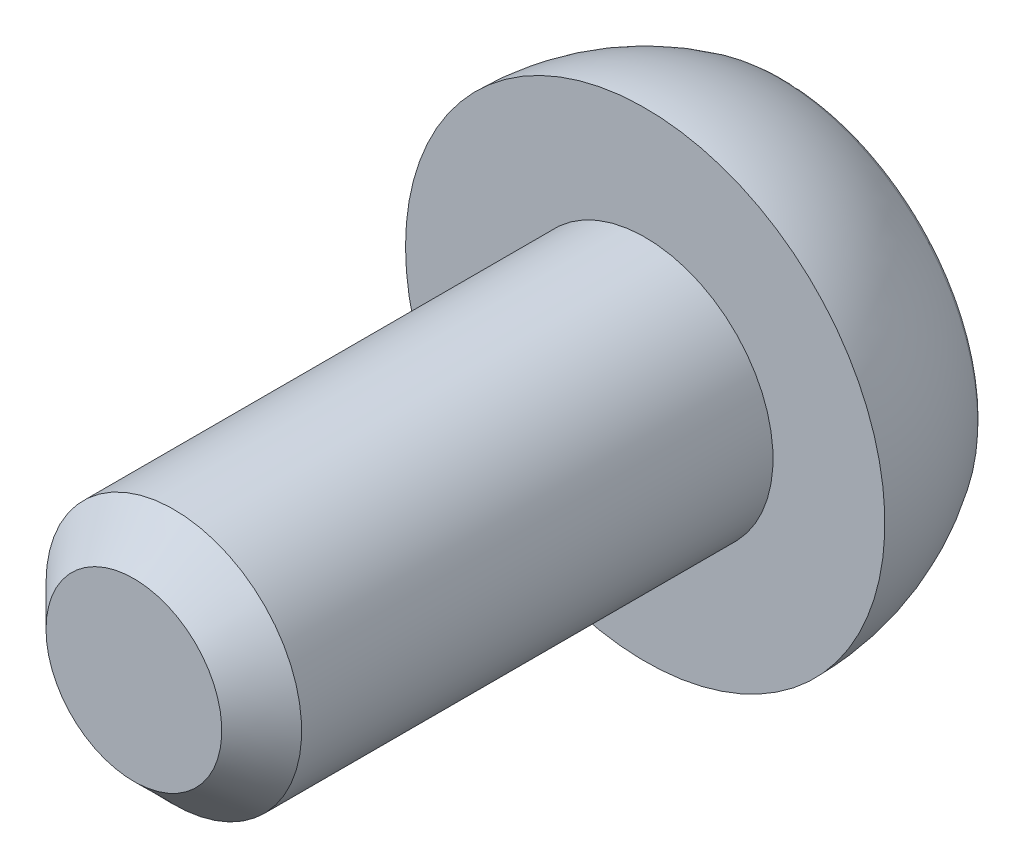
ISO-10303-21;
HEADER;
FILE_DESCRIPTION(('STEP AP214'),'2;1');
FILE_NAME('part.step','',(''),(''),'','','');
FILE_SCHEMA(('AUTOMOTIVE_DESIGN { 1 0 10303 214 1 1 1 1 }'));
ENDSEC;
DATA;
#1=APPLICATION_CONTEXT('core data for automotive mechanical design processes');
#2=APPLICATION_PROTOCOL_DEFINITION('international standard','automotive_design',2000,#1);
#3=PRODUCT_CONTEXT('',#1,'mechanical');
#4=PRODUCT('Part','Part','',(#3));
#5=PRODUCT_RELATED_PRODUCT_CATEGORY('part','',(#4));
#6=PRODUCT_DEFINITION_FORMATION('','',#4);
#7=PRODUCT_DEFINITION_CONTEXT('part definition',#1,'design');
#8=PRODUCT_DEFINITION('design','',#6,#7);
#9=PRODUCT_DEFINITION_SHAPE('','',#8);
#10=(LENGTH_UNIT() NAMED_UNIT(*) SI_UNIT(.MILLI.,.METRE.));
#11=(NAMED_UNIT(*) PLANE_ANGLE_UNIT() SI_UNIT($,.RADIAN.));
#12=(NAMED_UNIT(*) SI_UNIT($,.STERADIAN.) SOLID_ANGLE_UNIT());
#13=UNCERTAINTY_MEASURE_WITH_UNIT(LENGTH_MEASURE(1.E-05),#10,'distance_accuracy_value','');
#14=(GEOMETRIC_REPRESENTATION_CONTEXT(3) GLOBAL_UNCERTAINTY_ASSIGNED_CONTEXT((#13)) GLOBAL_UNIT_ASSIGNED_CONTEXT((#10,
#11,#12)) REPRESENTATION_CONTEXT('',''));
#15=CARTESIAN_POINT('',(0.,0.,0.));
#16=DIRECTION('',(0.,0.,1.));
#17=DIRECTION('',(1.,0.,0.));
#18=AXIS2_PLACEMENT_3D('',#15,#16,#17);
#19=CARTESIAN_POINT('',(63.50170234,216.57144045,-19.));
#20=DIRECTION('',(0.,0.,-1.));
#21=DIRECTION('',(-0.999977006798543,-0.00678128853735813,0.));
#22=AXIS2_PLACEMENT_3D('',#19,#20,#21);
#23=PLANE('',#22);
#24=CARTESIAN_POINT('',(60.699894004,219.335504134,-19.));
#25=DIRECTION('',(0.,0.,-1.));
#26=DIRECTION('',(-1.,0.,0.));
#27=AXIS2_PLACEMENT_3D('',#24,#25,#26);
#28=CIRCLE('',#27,2.75000000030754);
#29=CARTESIAN_POINT('',(57.9498940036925,219.335504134,-19.));
#30=VERTEX_POINT('',#29);
#31=EDGE_CURVE('E17',#30,#30,#28,.F.);
#32=ORIENTED_EDGE('',*,*,#31,.T.);
#33=EDGE_LOOP('',(#32));
#34=FACE_BOUND('',#33,.T.);
#35=ADVANCED_FACE('F12',(#34),#23,.F.);
#36=CARTESIAN_POINT('',(60.699894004,219.335504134,-19.));
#37=DIRECTION('',(0.,0.,-1.));
#38=DIRECTION('',(-1.,0.,0.));
#39=AXIS2_PLACEMENT_3D('',#36,#37,#38);
#40=CONICAL_SURFACE('',#39,2.75000000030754,0.785398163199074);
#41=CARTESIAN_POINT('',(60.699894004,219.335504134,-20.25));
#42=DIRECTION('',(0.,0.,-1.));
#43=DIRECTION('',(-0.999977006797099,-0.00678128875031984,0.));
#44=AXIS2_PLACEMENT_3D('',#41,#42,#43);
#45=CIRCLE('',#44,3.9999999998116);
#46=CARTESIAN_POINT('',(56.699985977,219.308378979,-20.25));
#47=VERTEX_POINT('',#46);
#48=EDGE_CURVE('E95',#47,#47,#45,.F.);
#49=ORIENTED_EDGE('',*,*,#48,.T.);
#50=EDGE_LOOP('',(#49));
#51=FACE_BOUND('',#50,.T.);
#52=ORIENTED_EDGE('',*,*,#31,.F.);
#53=EDGE_LOOP('',(#52));
#54=FACE_BOUND('',#53,.T.);
#55=ADVANCED_FACE('F262',(#51,#54),#40,.T.);
#56=CARTESIAN_POINT('',(65.729142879,215.039383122,-35.5));
#57=DIRECTION('',(0.,0.,-1.));
#58=DIRECTION('',(-0.99997700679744,-0.00678128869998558,0.));
#59=AXIS2_PLACEMENT_3D('',#56,#57,#58);
#60=PLANE('',#59);
#61=DIRECTION('',(-0.49411573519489,-0.869396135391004,0.));
#62=VECTOR('',#61,1.);
#63=CARTESIAN_POINT('',(64.4644897,217.1959202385,-35.5));
#64=LINE('',#63,#62);
#65=CARTESIAN_POINT('',(65.6997790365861,219.369410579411,-35.5));
#66=VERTEX_POINT('',#65);
#67=CARTESIAN_POINT('',(63.229200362,215.022429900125,-35.5));
#68=VERTEX_POINT('',#67);
#69=EDGE_CURVE('E107',#66,#68,#64,.T.);
#70=ORIENTED_EDGE('',*,*,#69,.T.);
#71=DIRECTION('',(-0.999977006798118,-0.00678128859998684,0.));
#72=VECTOR('',#71,1.);
#73=CARTESIAN_POINT('',(60.729257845,215.0054766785,-35.5));
#74=LINE('',#73,#72);
#75=CARTESIAN_POINT('',(58.229315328,214.988523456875,-35.5));
#76=VERTEX_POINT('',#75);
#77=EDGE_CURVE('E86',#68,#76,#74,.T.);
#78=ORIENTED_EDGE('',*,*,#77,.T.);
#79=DIRECTION('',(-0.505861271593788,0.862614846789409,0.));
#80=VECTOR('',#79,1.);
#81=CARTESIAN_POINT('',(56.964662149,217.145060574,-35.5));
#82=LINE('',#81,#80);
#83=CARTESIAN_POINT('',(55.7000089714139,219.301597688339,-35.5));
#84=VERTEX_POINT('',#83);
#85=EDGE_CURVE('E81',#76,#84,#82,.T.);
#86=ORIENTED_EDGE('',*,*,#85,.T.);
#87=DIRECTION('',(0.494115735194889,0.869396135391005,0.));
#88=VECTOR('',#87,1.);
#89=CARTESIAN_POINT('',(56.935298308,221.4750880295,-35.5));
#90=LINE('',#89,#88);
#91=CARTESIAN_POINT('',(58.170587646,223.648578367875,-35.5));
#92=VERTEX_POINT('',#91);
#93=EDGE_CURVE('E84',#84,#92,#90,.T.);
#94=ORIENTED_EDGE('',*,*,#93,.T.);
#95=DIRECTION('',(0.999977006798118,0.00678128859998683,0.));
#96=VECTOR('',#95,1.);
#97=CARTESIAN_POINT('',(60.670530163,223.6655315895,-35.5));
#98=LINE('',#97,#96);
#99=CARTESIAN_POINT('',(63.17047268,223.68248481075,-35.5));
#100=VERTEX_POINT('',#99);
#101=EDGE_CURVE('E67',#92,#100,#98,.T.);
#102=ORIENTED_EDGE('',*,*,#101,.T.);
#103=DIRECTION('',(0.505861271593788,-0.862614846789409,0.));
#104=VECTOR('',#103,1.);
#105=CARTESIAN_POINT('',(64.435125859,221.525947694,-35.5));
#106=LINE('',#105,#104);
#107=EDGE_CURVE('E114',#100,#66,#106,.T.);
#108=ORIENTED_EDGE('',*,*,#107,.T.);
#109=EDGE_LOOP('',(#70,#78,#86,#94,#102,#108));
#110=FACE_BOUND('',#109,.T.);
#111=ADVANCED_FACE('F83',(#110),#60,.T.);
#112=CARTESIAN_POINT('',(60.699894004,219.335504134,-20.25));
#113=DIRECTION('',(0.,0.,-1.));
#114=DIRECTION('',(-1.,0.,0.));
#115=AXIS2_PLACEMENT_3D('',#112,#113,#114);
#116=CYLINDRICAL_SURFACE('',#115,3.99999999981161);
#117=CARTESIAN_POINT('',(60.699894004,219.335504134,-35.));
#118=DIRECTION('',(0.,0.,-1.));
#119=DIRECTION('',(-1.,0.,0.));
#120=AXIS2_PLACEMENT_3D('',#117,#118,#119);
#121=CIRCLE('',#120,3.99999999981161);
#122=CARTESIAN_POINT('',(56.6998940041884,219.335504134,-35.));
#123=VERTEX_POINT('',#122);
#124=EDGE_CURVE('E127',#123,#123,#121,.F.);
#125=ORIENTED_EDGE('',*,*,#124,.T.);
#126=EDGE_LOOP('',(#125));
#127=FACE_BOUND('',#126,.T.);
#128=ORIENTED_EDGE('',*,*,#48,.F.);
#129=EDGE_LOOP('',(#128));
#130=FACE_BOUND('',#129,.T.);
#131=ADVANCED_FACE('F260',(#127,#130),#116,.T.);
#132=CARTESIAN_POINT('',(58.170587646,223.648578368,-39.4));
#133=DIRECTION('',(-0.869396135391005,0.494115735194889,0.));
#134=DIRECTION('',(-0.494115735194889,-0.869396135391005,0.));
#135=AXIS2_PLACEMENT_3D('',#132,#133,#134);
#136=PLANE('',#135);
#137=DIRECTION('',(0.,0.,1.));
#138=VECTOR('',#137,1.);
#139=CARTESIAN_POINT('',(58.170587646,223.648578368,-37.45));
#140=LINE('',#139,#138);
#141=CARTESIAN_POINT('',(58.170587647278,223.648578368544,-39.4));
#142=VERTEX_POINT('',#141);
#143=EDGE_CURVE('E94',#142,#92,#140,.T.);
#144=ORIENTED_EDGE('',*,*,#143,.T.);
#145=ORIENTED_EDGE('',*,*,#93,.F.);
#146=DIRECTION('',(0.,0.,-1.));
#147=VECTOR('',#146,1.);
#148=CARTESIAN_POINT('',(55.70000897,219.301597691,-37.45));
#149=LINE('',#148,#147);
#150=CARTESIAN_POINT('',(55.7000089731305,219.30159769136,-39.4));
#151=VERTEX_POINT('',#150);
#152=EDGE_CURVE('E90',#84,#151,#149,.T.);
#153=ORIENTED_EDGE('',*,*,#152,.T.);
#154=DIRECTION('',(-0.494115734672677,-0.8693961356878,0.));
#155=VECTOR('',#154,1.);
#156=CARTESIAN_POINT('',(58.1705876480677,223.648578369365,-39.4));
#157=LINE('',#156,#155);
#158=EDGE_CURVE('E58',#142,#151,#157,.T.);
#159=ORIENTED_EDGE('',*,*,#158,.F.);
#160=EDGE_LOOP('',(#144,#145,#153,#159));
#161=FACE_BOUND('',#160,.T.);
#162=ADVANCED_FACE('F92',(#161),#136,.F.);
#163=CARTESIAN_POINT('',(55.70000897,219.301597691,-39.4));
#164=DIRECTION('',(-0.862614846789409,-0.505861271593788,0.));
#165=DIRECTION('',(0.505861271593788,-0.862614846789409,0.));
#166=AXIS2_PLACEMENT_3D('',#163,#164,#165);
#167=PLANE('',#166);
#168=ORIENTED_EDGE('',*,*,#152,.F.);
#169=ORIENTED_EDGE('',*,*,#85,.F.);
#170=DIRECTION('',(0.,0.,-1.));
#171=VECTOR('',#170,1.);
#172=CARTESIAN_POINT('',(58.229315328,214.988523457,-37.45));
#173=LINE('',#172,#171);
#174=CARTESIAN_POINT('',(58.2293153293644,214.988523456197,-39.4));
#175=VERTEX_POINT('',#174);
#176=EDGE_CURVE('E101',#76,#175,#173,.T.);
#177=ORIENTED_EDGE('',*,*,#176,.T.);
#178=DIRECTION('',(0.505861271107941,-0.862614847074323,0.));
#179=VECTOR('',#178,1.);
#180=CARTESIAN_POINT('',(55.7000089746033,219.301597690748,-39.4));
#181=LINE('',#180,#179);
#182=EDGE_CURVE('E99',#151,#175,#181,.T.);
#183=ORIENTED_EDGE('',*,*,#182,.F.);
#184=EDGE_LOOP('',(#168,#169,#177,#183));
#185=FACE_BOUND('',#184,.T.);
#186=ADVANCED_FACE('F97',(#185),#167,.F.);
#187=CARTESIAN_POINT('',(58.229315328,214.988523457,-35.5));
#188=DIRECTION('',(0.00678128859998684,-0.999977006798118,0.));
#189=DIRECTION('',(0.,0.,-1.));
#190=AXIS2_PLACEMENT_3D('',#187,#188,#189);
#191=PLANE('',#190);
#192=ORIENTED_EDGE('',*,*,#176,.F.);
#193=ORIENTED_EDGE('',*,*,#77,.F.);
#194=DIRECTION('',(0.,0.,-1.));
#195=VECTOR('',#194,1.);
#196=CARTESIAN_POINT('',(63.229200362,215.0224299,-37.45));
#197=LINE('',#196,#195);
#198=CARTESIAN_POINT('',(63.2292003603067,215.022429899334,-39.4));
#199=VERTEX_POINT('',#198);
#200=EDGE_CURVE('E112',#68,#199,#197,.T.);
#201=ORIENTED_EDGE('',*,*,#200,.T.);
#202=DIRECTION('',(0.999977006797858,0.00678128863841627,0.));
#203=VECTOR('',#202,1.);
#204=CARTESIAN_POINT('',(60.7292578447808,215.005476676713,-39.4));
#205=LINE('',#204,#203);
#206=EDGE_CURVE('E108',#175,#199,#205,.T.);
#207=ORIENTED_EDGE('',*,*,#206,.F.);
#208=EDGE_LOOP('',(#192,#193,#201,#207));
#209=FACE_BOUND('',#208,.T.);
#210=ADVANCED_FACE('F252',(#209),#191,.F.);
#211=CARTESIAN_POINT('',(63.229200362,215.0224299,-39.4));
#212=DIRECTION('',(0.869396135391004,-0.49411573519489,0.));
#213=DIRECTION('',(0.49411573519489,0.869396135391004,0.));
#214=AXIS2_PLACEMENT_3D('',#211,#212,#213);
#215=PLANE('',#214);
#216=ORIENTED_EDGE('',*,*,#200,.F.);
#217=ORIENTED_EDGE('',*,*,#69,.F.);
#218=DIRECTION('',(0.,0.,-1.));
#219=VECTOR('',#218,1.);
#220=CARTESIAN_POINT('',(65.699779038,219.369410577,-37.45));
#221=LINE('',#220,#219);
#222=CARTESIAN_POINT('',(65.6997790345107,219.369410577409,-39.4));
#223=VERTEX_POINT('',#222);
#224=EDGE_CURVE('E181',#66,#223,#221,.T.);
#225=ORIENTED_EDGE('',*,*,#224,.T.);
#226=DIRECTION('',(0.494115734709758,0.869396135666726,0.));
#227=VECTOR('',#226,1.);
#228=CARTESIAN_POINT('',(63.2292003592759,215.022429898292,-39.4));
#229=LINE('',#228,#227);
#230=EDGE_CURVE('E111',#199,#223,#229,.T.);
#231=ORIENTED_EDGE('',*,*,#230,.F.);
#232=EDGE_LOOP('',(#216,#217,#225,#231));
#233=FACE_BOUND('',#232,.T.);
#234=ADVANCED_FACE('F246',(#233),#215,.F.);
#235=CARTESIAN_POINT('',(65.699779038,219.369410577,-39.4));
#236=DIRECTION('',(0.862614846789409,0.505861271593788,0.));
#237=DIRECTION('',(-0.505861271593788,0.862614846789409,0.));
#238=AXIS2_PLACEMENT_3D('',#235,#236,#237);
#239=PLANE('',#238);
#240=ORIENTED_EDGE('',*,*,#224,.F.);
#241=ORIENTED_EDGE('',*,*,#107,.F.);
#242=DIRECTION('',(0.,0.,-1.));
#243=VECTOR('',#242,1.);
#244=CARTESIAN_POINT('',(63.17047268,223.682484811,-37.45));
#245=LINE('',#244,#243);
#246=CARTESIAN_POINT('',(63.1704726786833,223.682484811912,-39.4));
#247=VERTEX_POINT('',#246);
#248=EDGE_CURVE('E139',#100,#247,#245,.T.);
#249=ORIENTED_EDGE('',*,*,#248,.T.);
#250=DIRECTION('',(-0.505861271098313,0.862614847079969,0.));
#251=VECTOR('',#250,1.);
#252=CARTESIAN_POINT('',(65.6997790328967,219.369410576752,-39.4));
#253=LINE('',#252,#251);
#254=EDGE_CURVE('E119',#223,#247,#253,.T.);
#255=ORIENTED_EDGE('',*,*,#254,.F.);
#256=EDGE_LOOP('',(#240,#241,#249,#255));
#257=FACE_BOUND('',#256,.T.);
#258=ADVANCED_FACE('F242',(#257),#239,.F.);
#259=CARTESIAN_POINT('',(58.170587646,223.648578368,-39.4));
#260=DIRECTION('',(-0.00678128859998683,0.999977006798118,0.));
#261=DIRECTION('',(0.,0.,1.));
#262=AXIS2_PLACEMENT_3D('',#259,#260,#261);
#263=PLANE('',#262);
#264=ORIENTED_EDGE('',*,*,#248,.F.);
#265=ORIENTED_EDGE('',*,*,#101,.F.);
#266=ORIENTED_EDGE('',*,*,#143,.F.);
#267=DIRECTION('',(-0.999977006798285,-0.00678128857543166,0.));
#268=VECTOR('',#267,1.);
#269=CARTESIAN_POINT('',(60.6705301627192,223.665531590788,-39.4));
#270=LINE('',#269,#268);
#271=EDGE_CURVE('E122',#247,#142,#270,.T.);
#272=ORIENTED_EDGE('',*,*,#271,.F.);
#273=EDGE_LOOP('',(#264,#265,#266,#272));
#274=FACE_BOUND('',#273,.T.);
#275=ADVANCED_FACE('F194',(#274),#263,.F.);
#276=CARTESIAN_POINT('',(60.739313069,213.52272114,-39.4));
#277=CARTESIAN_POINT('',(49.113747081,213.443883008,-39.4));
#278=CARTESIAN_POINT('',(49.03490895,225.069448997,-39.4));
#279=CARTESIAN_POINT('',(60.660474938,225.148287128,-39.4));
#280=CARTESIAN_POINT('',(60.740467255,213.35252351,-39.4));
#281=CARTESIAN_POINT('',(48.774506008,213.271377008,-39.4));
#282=CARTESIAN_POINT('',(48.693359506,225.237338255,-39.4));
#283=CARTESIAN_POINT('',(60.659320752,225.318484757,-39.4));
#284=CARTESIAN_POINT('',(60.741485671,213.202346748,-39.319909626));
#285=CARTESIAN_POINT('',(48.475170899,213.119163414,-39.319909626));
#286=CARTESIAN_POINT('',(48.391987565,225.385478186,-39.319909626));
#287=CARTESIAN_POINT('',(60.658302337,225.46866152,-39.319909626));
#288=CARTESIAN_POINT('',(60.742128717,213.107522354,-39.178571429));
#289=CARTESIAN_POINT('',(48.286165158,213.023052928,-39.178571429));
#290=CARTESIAN_POINT('',(48.201695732,225.479016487,-39.178571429));
#291=CARTESIAN_POINT('',(60.657659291,225.563485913,-39.178571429));
#292=(BOUNDED_SURFACE() B_SPLINE_SURFACE(3,3,((#276,#277,#278,#279),(#280,#281,#282,#283),(#284,
#285,#286,#287),(#288,#289,#290,#291)),.UNSPECIFIED.,.F.,.F.,
.F.) B_SPLINE_SURFACE_WITH_KNOTS((4,4),(4,4),(0.,1.),(0.,1.),
.UNSPECIFIED.) GEOMETRIC_REPRESENTATION_ITEM() RATIONAL_B_SPLINE_SURFACE(((1.,0.333333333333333,
0.333333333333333,1.),(0.921577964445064,0.307192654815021,0.307192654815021,0.921577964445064),
(0.921577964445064,0.307192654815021,0.307192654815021,0.921577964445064),(1.,0.333333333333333,
0.333333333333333,1.))) REPRESENTATION_ITEM('') SURFACE());
#293=CARTESIAN_POINT('',(60.660474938,225.148287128,-39.4));
#294=CARTESIAN_POINT('',(60.659320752,225.318484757,-39.4));
#295=CARTESIAN_POINT('',(60.658302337,225.46866152,-39.319909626));
#296=CARTESIAN_POINT('',(60.657659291,225.563485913,-39.178571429));
#297=(BOUNDED_CURVE() B_SPLINE_CURVE(3,(#293,#294,#295,#296),.UNSPECIFIED.,.F.,
.F.) B_SPLINE_CURVE_WITH_KNOTS((4,4),(0.,1.),
.UNSPECIFIED.) CURVE() GEOMETRIC_REPRESENTATION_ITEM() RATIONAL_B_SPLINE_CURVE((1.,
0.921577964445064,0.921577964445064,1.)) REPRESENTATION_ITEM(''));
#298=CARTESIAN_POINT('',(60.6576592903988,225.563485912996,-39.178571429));
#299=VERTEX_POINT('',#298);
#300=CARTESIAN_POINT('',(60.6604749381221,225.148287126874,-39.4));
#301=VERTEX_POINT('',#300);
#302=EDGE_CURVE('E129',#299,#301,#297,.F.);
#303=CARTESIAN_POINT('',(60.660474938,225.148287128,-39.4));
#304=CARTESIAN_POINT('',(49.03490895,225.069448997,-39.4));
#305=CARTESIAN_POINT('',(49.113747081,213.443883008,-39.4));
#306=CARTESIAN_POINT('',(60.739313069,213.52272114,-39.4));
#307=(BOUNDED_CURVE() B_SPLINE_CURVE(3,(#303,#304,#305,#306),.UNSPECIFIED.,.F.,
.F.) B_SPLINE_CURVE_WITH_KNOTS((4,4),(0.,1.),
.UNSPECIFIED.) CURVE() GEOMETRIC_REPRESENTATION_ITEM() RATIONAL_B_SPLINE_CURVE((1.,
0.333333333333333,0.333333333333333,1.)) REPRESENTATION_ITEM(''));
#308=CARTESIAN_POINT('',(60.7393130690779,213.522721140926,-39.4));
#309=VERTEX_POINT('',#308);
#310=EDGE_CURVE('E126',#309,#301,#307,.F.);
#311=CARTESIAN_POINT('',(60.739313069,213.52272114,-39.4));
#312=CARTESIAN_POINT('',(60.740467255,213.35252351,-39.4));
#313=CARTESIAN_POINT('',(60.741485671,213.202346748,-39.319909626));
#314=CARTESIAN_POINT('',(60.742128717,213.107522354,-39.178571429));
#315=(BOUNDED_CURVE() B_SPLINE_CURVE(3,(#311,#312,#313,#314),.UNSPECIFIED.,.F.,
.F.) B_SPLINE_CURVE_WITH_KNOTS((4,4),(0.,1.),
.UNSPECIFIED.) CURVE() GEOMETRIC_REPRESENTATION_ITEM() RATIONAL_B_SPLINE_CURVE((1.,
0.921577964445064,0.921577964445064,1.)) REPRESENTATION_ITEM(''));
#316=CARTESIAN_POINT('',(60.7421287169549,213.107522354,-39.178571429));
#317=VERTEX_POINT('',#316);
#318=EDGE_CURVE('E133',#309,#317,#315,.T.);
#319=CARTESIAN_POINT('',(60.699894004,219.335504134,-39.1785713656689));
#320=DIRECTION('',(0.,0.,-1.));
#321=DIRECTION('',(0.999977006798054,0.00678128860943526,0.));
#322=AXIS2_PLACEMENT_3D('',#319,#320,#321);
#323=CIRCLE('',#322,6.22812502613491);
#324=EDGE_CURVE('E118',#317,#299,#323,.T.);
#325=ORIENTED_EDGE('',*,*,#302,.T.);
#326=ORIENTED_EDGE('',*,*,#310,.F.);
#327=ORIENTED_EDGE('',*,*,#318,.T.);
#328=ORIENTED_EDGE('',*,*,#324,.T.);
#329=EDGE_LOOP('',(#325,#326,#327,#328));
#330=FACE_BOUND('',#329,.T.);
#331=ADVANCED_FACE('F208',(#330),#292,.T.);
#332=CARTESIAN_POINT('',(68.341189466,211.797148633,-35.));
#333=DIRECTION('',(0.,0.,-1.));
#334=DIRECTION('',(-0.999977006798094,-0.00678128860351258,0.));
#335=AXIS2_PLACEMENT_3D('',#332,#333,#334);
#336=PLANE('',#335);
#337=ORIENTED_EDGE('',*,*,#124,.F.);
#338=EDGE_LOOP('',(#337));
#339=FACE_BOUND('',#338,.T.);
#340=CARTESIAN_POINT('',(60.699894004,219.335504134,-35.));
#341=DIRECTION('',(0.,0.,-1.));
#342=DIRECTION('',(-1.,0.,0.));
#343=AXIS2_PLACEMENT_3D('',#340,#341,#342);
#344=CIRCLE('',#343,7.50000000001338);
#345=CARTESIAN_POINT('',(53.1998940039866,219.335504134,-35.));
#346=VERTEX_POINT('',#345);
#347=EDGE_CURVE('E115',#346,#346,#344,.F.);
#348=ORIENTED_EDGE('',*,*,#347,.T.);
#349=EDGE_LOOP('',(#348));
#350=FACE_BOUND('',#349,.T.);
#351=ADVANCED_FACE('F236',(#339,#350),#336,.F.);
#352=CARTESIAN_POINT('',(54.857249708,213.413075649,-39.4));
#353=DIRECTION('',(0.,0.,-1.));
#354=DIRECTION('',(-0.00678128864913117,0.999977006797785,0.));
#355=AXIS2_PLACEMENT_3D('',#352,#353,#354);
#356=PLANE('',#355);
#357=ORIENTED_EDGE('',*,*,#254,.T.);
#358=ORIENTED_EDGE('',*,*,#271,.T.);
#359=ORIENTED_EDGE('',*,*,#158,.T.);
#360=ORIENTED_EDGE('',*,*,#182,.T.);
#361=ORIENTED_EDGE('',*,*,#206,.T.);
#362=ORIENTED_EDGE('',*,*,#230,.T.);
#363=EDGE_LOOP('',(#357,#358,#359,#360,#361,#362));
#364=FACE_BOUND('',#363,.T.);
#365=CARTESIAN_POINT('',(60.739313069,213.52272114,-39.4));
#366=CARTESIAN_POINT('',(60.8008187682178,213.523137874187,-39.4));
#367=CARTESIAN_POINT('',(60.8623179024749,213.524531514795,-39.4));
#368=CARTESIAN_POINT('',(60.9871907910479,213.529344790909,-39.4));
#369=CARTESIAN_POINT('',(61.0505621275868,213.532827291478,-39.4));
#370=CARTESIAN_POINT('',(61.1791615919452,213.542008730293,-39.4));
#371=CARTESIAN_POINT('',(61.2443849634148,213.54777437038,-39.4));
#372=CARTESIAN_POINT('',(61.3766560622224,213.561722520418,-39.4));
#373=CARTESIAN_POINT('',(61.443696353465,213.569975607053,-39.4));
#374=CARTESIAN_POINT('',(61.5795521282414,213.589109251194,-39.4));
#375=CARTESIAN_POINT('',(61.6483571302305,213.600064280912,-39.4));
#376=CARTESIAN_POINT('',(61.787674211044,213.624821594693,-39.4));
#377=CARTESIAN_POINT('',(61.8581723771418,213.638702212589,-39.4));
#378=CARTESIAN_POINT('',(62.0007863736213,213.669538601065,-39.4));
#379=CARTESIAN_POINT('',(62.0728844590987,213.686576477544,-39.4));
#380=CARTESIAN_POINT('',(62.2185851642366,213.723961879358,-39.4));
#381=CARTESIAN_POINT('',(62.2921657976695,213.744395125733,-39.4));
#382=CARTESIAN_POINT('',(62.4406922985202,213.78881043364,-39.4));
#383=CARTESIAN_POINT('',(62.5156115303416,213.812881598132,-39.4));
#384=CARTESIAN_POINT('',(62.6666473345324,213.864814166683,-39.4));
#385=CARTESIAN_POINT('',(62.7427322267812,213.892767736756,-39.4));
#386=CARTESIAN_POINT('',(62.8959005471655,213.952705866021,-39.4));
#387=CARTESIAN_POINT('',(62.9729468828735,213.984785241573,-39.4));
#388=CARTESIAN_POINT('',(63.1278062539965,214.053211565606,-39.4));
#389=CARTESIAN_POINT('',(63.2055764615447,214.089655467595,-39.4));
#390=CARTESIAN_POINT('',(63.3616168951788,214.16703919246,-39.4));
#391=CARTESIAN_POINT('',(63.4398382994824,214.208077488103,-39.4));
#392=CARTESIAN_POINT('',(63.596478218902,214.294865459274,-39.4));
#393=CARTESIAN_POINT('',(63.6748417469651,214.340714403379,-39.4));
#394=CARTESIAN_POINT('',(63.8314259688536,214.437321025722,-39.4));
#395=CARTESIAN_POINT('',(63.9095854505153,214.48817794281,-39.4));
#396=CARTESIAN_POINT('',(64.0653845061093,214.594974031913,-39.4));
#397=CARTESIAN_POINT('',(64.1429567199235,214.651011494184,-39.4));
#398=CARTESIAN_POINT('',(64.2971678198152,214.768312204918,-39.4));
#399=CARTESIAN_POINT('',(64.3737334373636,214.829671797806,-39.4));
#400=CARTESIAN_POINT('',(64.5254833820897,214.95772385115,-39.4));
#401=CARTESIAN_POINT('',(64.6005889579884,215.024509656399,-39.4));
#402=CARTESIAN_POINT('',(64.7489392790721,215.163478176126,-39.4));
#403=CARTESIAN_POINT('',(64.8221004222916,215.235750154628,-39.4));
#404=CARTESIAN_POINT('',(64.9660549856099,215.385705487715,-39.4));
#405=CARTESIAN_POINT('',(65.0367608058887,215.463472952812,-39.4));
#406=CARTESIAN_POINT('',(65.1752760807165,215.624378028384,-39.4));
#407=CARTESIAN_POINT('',(65.2429950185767,215.707593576,-39.4));
#408=CARTESIAN_POINT('',(65.374992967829,215.879292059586,-39.4));
#409=CARTESIAN_POINT('',(65.4391798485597,215.967845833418,-39.4));
#410=CARTESIAN_POINT('',(65.5635638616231,216.150052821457,-39.4));
#411=CARTESIAN_POINT('',(65.6236687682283,216.243769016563,-39.4));
#412=CARTESIAN_POINT('',(65.7393406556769,216.436060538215,-39.4));
#413=CARTESIAN_POINT('',(65.7948169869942,216.534690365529,-39.4));
#414=CARTESIAN_POINT('',(65.9007015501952,216.736509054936,-39.4));
#415=CARTESIAN_POINT('',(65.9510226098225,216.839743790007,-39.4));
#416=CARTESIAN_POINT('',(66.0220853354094,216.997205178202,-39.4));
#417=CARTESIAN_POINT('',(66.0451403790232,217.050399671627,-39.4));
#418=CARTESIAN_POINT('',(66.0897858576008,217.157783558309,-39.4));
#419=CARTESIAN_POINT('',(66.1113664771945,217.21197704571,-39.4));
#420=CARTESIAN_POINT('',(66.1530044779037,217.321297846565,-39.4));
#421=CARTESIAN_POINT('',(66.1730525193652,217.376428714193,-39.4));
#422=CARTESIAN_POINT('',(66.2115712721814,217.487561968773,-39.4));
#423=CARTESIAN_POINT('',(66.2300331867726,217.54356740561,-39.4));
#424=CARTESIAN_POINT('',(66.2653285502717,217.656382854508,-39.4));
#425=CARTESIAN_POINT('',(66.2821537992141,217.713195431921,-39.4));
#426=CARTESIAN_POINT('',(66.3141285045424,217.827554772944,-39.4));
#427=CARTESIAN_POINT('',(66.3292704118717,217.885103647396,-39.4));
#428=CARTESIAN_POINT('',(66.357835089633,218.000861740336,-39.4));
#429=CARTESIAN_POINT('',(66.3712510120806,218.059072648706,-39.4));
#430=CARTESIAN_POINT('',(66.3963246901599,218.176077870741,-39.4));
#431=CARTESIAN_POINT('',(66.4079763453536,218.234873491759,-39.4));
#432=CARTESIAN_POINT('',(66.4294870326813,218.352968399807,-39.4));
#433=CARTESIAN_POINT('',(66.4393407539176,218.412268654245,-39.4));
#434=CARTESIAN_POINT('',(66.4572259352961,218.531290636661,-39.4));
#435=CARTESIAN_POINT('',(66.4652529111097,218.591013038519,-39.4));
#436=CARTESIAN_POINT('',(66.4794599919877,218.710795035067,-39.4));
#437=CARTESIAN_POINT('',(66.4856364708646,218.770855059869,-39.4));
#438=CARTESIAN_POINT('',(66.4961231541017,218.891226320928,-39.4));
#439=CARTESIAN_POINT('',(66.5004306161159,218.951537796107,-39.4));
#440=CARTESIAN_POINT('',(66.5071652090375,219.072324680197,-39.4));
#441=CARTESIAN_POINT('',(66.5095905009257,219.132800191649,-39.4));
#442=CARTESIAN_POINT('',(66.5125521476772,219.253826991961,-39.4));
#443=CARTESIAN_POINT('',(66.5130875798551,219.314378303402,-39.4));
#444=CARTESIAN_POINT('',(66.5122664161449,219.435468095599,-39.4));
#445=CARTESIAN_POINT('',(66.5109098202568,219.496006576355,-39.4));
#446=CARTESIAN_POINT('',(66.5063070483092,219.616982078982,-39.4));
#447=CARTESIAN_POINT('',(66.5030617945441,219.677419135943,-39.4));
#448=CARTESIAN_POINT('',(66.4946896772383,219.798103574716,-39.4));
#449=CARTESIAN_POINT('',(66.4895646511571,219.858351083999,-39.4));
#450=CARTESIAN_POINT('',(66.4774464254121,219.978569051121,-39.4));
#451=CARTESIAN_POINT('',(66.4704559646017,220.038539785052,-39.4));
#452=CARTESIAN_POINT('',(66.4546256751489,220.158118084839,-39.4));
#453=CARTESIAN_POINT('',(66.4457894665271,220.217726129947,-39.4));
#454=CARTESIAN_POINT('',(66.4262917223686,220.336494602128,-39.4));
#455=CARTESIAN_POINT('',(66.4156346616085,220.395655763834,-39.4));
#456=CARTESIAN_POINT('',(66.3925243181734,220.513448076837,-39.4));
#457=CARTESIAN_POINT('',(66.3800763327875,220.572080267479,-39.4));
#458=CARTESIAN_POINT('',(66.3534181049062,220.688734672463,-39.4));
#459=CARTESIAN_POINT('',(66.3392139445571,220.746758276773,-39.4));
#460=CARTESIAN_POINT('',(66.3090819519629,220.862118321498,-39.4));
#461=CARTESIAN_POINT('',(66.2931609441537,220.919456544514,-39.4));
#462=CARTESIAN_POINT('',(66.2596382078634,221.033371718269,-39.4));
#463=CARTESIAN_POINT('',(66.2420439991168,221.089950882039,-39.4));
#464=CARTESIAN_POINT('',(66.2052218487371,221.202277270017,-39.4));
#465=CARTESIAN_POINT('',(66.1860020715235,221.25802717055,-39.4));
#466=CARTESIAN_POINT('',(66.1459796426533,221.368627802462,-39.4));
#467=CARTESIAN_POINT('',(66.1251857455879,221.423481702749,-39.4));
#468=CARTESIAN_POINT('',(66.0820689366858,221.532227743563,-39.4));
#469=CARTESIAN_POINT('',(66.0597553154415,221.586123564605,-39.4));
#470=CARTESIAN_POINT('',(66.013657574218,221.692892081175,-39.4));
#471=CARTESIAN_POINT('',(65.9898832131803,221.745769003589,-39.4));
#472=CARTESIAN_POINT('',(65.9166914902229,221.902252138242,-39.4));
#473=CARTESIAN_POINT('',(65.8649749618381,222.004794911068,-39.4));
#474=CARTESIAN_POINT('',(65.7563630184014,222.205159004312,-39.4));
#475=CARTESIAN_POINT('',(65.699554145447,222.30302737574,-39.4));
#476=CARTESIAN_POINT('',(65.5812849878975,222.49373243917,-39.4));
#477=CARTESIAN_POINT('',(65.5199146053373,222.58662485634,-39.4));
#478=CARTESIAN_POINT('',(65.3930708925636,222.767128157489,-39.4));
#479=CARTESIAN_POINT('',(65.3276889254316,222.854803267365,-39.4));
#480=CARTESIAN_POINT('',(65.1933744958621,223.024695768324,-39.4));
#481=CARTESIAN_POINT('',(65.1245331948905,223.106985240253,-39.4));
#482=CARTESIAN_POINT('',(64.9838484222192,223.265996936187,-39.4));
#483=CARTESIAN_POINT('',(64.9120944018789,223.342798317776,-39.4));
#484=CARTESIAN_POINT('',(64.7661193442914,223.490787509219,-39.4));
#485=CARTESIAN_POINT('',(64.6919847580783,223.562060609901,-39.4));
#486=CARTESIAN_POINT('',(64.5417633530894,223.699004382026,-39.4));
#487=CARTESIAN_POINT('',(64.4657589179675,223.764765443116,-39.4));
#488=CARTESIAN_POINT('',(64.3122862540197,223.890747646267,-39.4));
#489=CARTESIAN_POINT('',(64.2348955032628,223.951063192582,-39.4));
#490=CARTESIAN_POINT('',(64.0791077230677,224.066261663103,-39.4));
#491=CARTESIAN_POINT('',(64.0007826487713,224.12124191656,-39.4));
#492=CARTESIAN_POINT('',(63.8435495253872,224.225915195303,-39.4));
#493=CARTESIAN_POINT('',(63.7647074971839,224.275707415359,-39.4));
#494=CARTESIAN_POINT('',(63.6068274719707,224.370181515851,-39.4));
#495=CARTESIAN_POINT('',(63.5278493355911,224.414963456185,-39.4));
#496=CARTESIAN_POINT('',(63.3700467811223,224.499619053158,-39.4));
#497=CARTESIAN_POINT('',(63.291275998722,224.539592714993,-39.4));
#498=CARTESIAN_POINT('',(63.1342004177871,224.614853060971,-39.4));
#499=CARTESIAN_POINT('',(63.0559431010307,224.650238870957,-39.4));
#500=CARTESIAN_POINT('',(62.9001699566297,224.716558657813,-39.4));
#501=CARTESIAN_POINT('',(62.8226956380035,224.747590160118,-39.4));
#502=CARTESIAN_POINT('',(62.6687285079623,224.805445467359,-39.4));
#503=CARTESIAN_POINT('',(62.5922714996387,224.832364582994,-39.4));
#504=CARTESIAN_POINT('',(62.4405452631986,224.882243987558,-39.4));
#505=CARTESIAN_POINT('',(62.3653064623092,224.905296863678,-39.4));
#506=CARTESIAN_POINT('',(62.216191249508,224.947693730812,-39.4));
#507=CARTESIAN_POINT('',(62.1423402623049,224.967127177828,-39.4));
#508=CARTESIAN_POINT('',(61.9961459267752,225.002533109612,-39.4));
#509=CARTESIAN_POINT('',(61.9238234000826,225.01859160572,-39.4));
#510=CARTESIAN_POINT('',(61.7808043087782,225.047490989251,-39.4));
#511=CARTESIAN_POINT('',(61.7101243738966,225.060414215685,-39.4));
#512=CARTESIAN_POINT('',(61.5704843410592,225.083279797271,-39.4));
#513=CARTESIAN_POINT('',(61.5015370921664,225.09330066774,-39.4));
#514=CARTESIAN_POINT('',(61.3654343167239,225.110590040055,-39.4));
#515=CARTESIAN_POINT('',(61.298288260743,225.117933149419,-39.4));
#516=CARTESIAN_POINT('',(61.1658401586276,225.130086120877,-39.4));
#517=CARTESIAN_POINT('',(61.1005445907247,225.134966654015,-39.4));
#518=CARTESIAN_POINT('',(60.9718324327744,225.142403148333,-39.4));
#519=CARTESIAN_POINT('',(60.9084196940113,225.145025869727,-39.4));
#520=CARTESIAN_POINT('',(60.7834930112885,225.148145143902,-39.4));
#521=CARTESIAN_POINT('',(60.7219806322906,225.148704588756,-39.4));
#522=CARTESIAN_POINT('',(60.660474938,225.148287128,-39.4));
#523=B_SPLINE_CURVE_WITH_KNOTS('',3,(#365,#366,#367,#368,#369,#370,#371,#372,#373,#374,#375,
#376,#377,#378,#379,#380,#381,#382,#383,#384,#385,#386,#387,#388,#389,#390,#391,#392,#393,#394,
#395,#396,#397,#398,#399,#400,#401,#402,#403,#404,#405,#406,#407,#408,#409,#410,#411,#412,#413,
#414,#415,#416,#417,#418,#419,#420,#421,#422,#423,#424,#425,#426,#427,#428,#429,#430,#431,#432,
#433,#434,#435,#436,#437,#438,#439,#440,#441,#442,#443,#444,#445,#446,#447,#448,#449,#450,#451,
#452,#453,#454,#455,#456,#457,#458,#459,#460,#461,#462,#463,#464,#465,#466,#467,#468,#469,#470,
#471,#472,#473,#474,#475,#476,#477,#478,#479,#480,#481,#482,#483,#484,#485,#486,#487,#488,#489,
#490,#491,#492,#493,#494,#495,#496,#497,#498,#499,#500,#501,#502,#503,#504,#505,#506,#507,#508,
#509,#510,#511,#512,#513,#514,#515,#516,#517,#518,#519,#520,#521,#522),.UNSPECIFIED.,.F.,.F.,(4,
2,2,2,2,2,2,2,2,2,2,2,2,2,2,2,2,2,2,2,2,2,2,2,2,2,2,2,2,2,2,2,2,2,2,2,2,2,2,2,2,2,2,2,2,2,2,2,2,
2,2,2,2,2,2,2,2,2,2,2,2,2,2,2,2,2,2,2,2,2,2,2,2,2,2,2,2,2,4),(0.,0.184513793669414,
0.374880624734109,0.57127638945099,0.773874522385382,0.982844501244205,1.19835014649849,
1.42054770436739,1.64958370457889,1.8855925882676,2.12869410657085,2.37899049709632,
2.63656345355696,2.90147091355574,3.17374370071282,3.45338206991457,3.74035221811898,
4.03458283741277,4.33596180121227,4.6443330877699,4.95949405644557,5.28119320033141,
5.60912850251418,5.94294652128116,6.28224232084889,6.62656034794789,6.80046639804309,
6.97543560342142,7.15139778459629,7.32828014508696,7.50600742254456,7.68450205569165,
7.86368436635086,8.04347275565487,8.22378391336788,8.40453303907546,8.5856340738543,
8.76699994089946,8.94854279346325,9.13017426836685,9.31180574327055,9.49334859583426,
9.67471446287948,9.85581549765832,10.0365646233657,10.216875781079,10.396664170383,
10.575846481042,10.7543411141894,10.932068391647,11.1089507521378,11.2849129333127,
11.4598821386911,11.6337881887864,11.9781062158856,12.3174020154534,12.6512200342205,
12.9791553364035,13.3008544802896,13.6160154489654,13.9243867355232,14.2257656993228,
14.5199963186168,14.8069664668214,15.0866048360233,15.3588776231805,15.6237850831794,
15.8813580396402,16.1316544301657,16.3747559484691,16.6107648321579,16.8398008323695,
17.0619983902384,17.2775040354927,17.4864740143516,17.689072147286,17.8854679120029,
18.0758347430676,18.260348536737),.UNSPECIFIED.);
#524=EDGE_CURVE('E9',#309,#301,#523,.T.);
#525=ORIENTED_EDGE('',*,*,#524,.F.);
#526=ORIENTED_EDGE('',*,*,#310,.T.);
#527=EDGE_LOOP('',(#525,#526));
#528=FACE_BOUND('',#527,.T.);
#529=ADVANCED_FACE('F14',(#364,#528),#356,.T.);
#530=CARTESIAN_POINT('',(60.6998940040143,219.335504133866,-34.999999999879));
#531=DIRECTION('',(0.,0.,-1.));
#532=DIRECTION('',(-0.999977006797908,-0.0067812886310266,0.));
#533=AXIS2_PLACEMENT_3D('',#530,#531,#532);
#534=SPHERICAL_SURFACE('',#533,7.5);
#535=ORIENTED_EDGE('',*,*,#347,.F.);
#536=EDGE_LOOP('',(#535));
#537=FACE_BOUND('',#536,.T.);
#538=CARTESIAN_POINT('',(60.699894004,219.3355041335,-39.178571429));
#539=DIRECTION('',(0.,0.,-1.));
#540=DIRECTION('',(-1.,0.,0.));
#541=AXIS2_PLACEMENT_3D('',#538,#539,#540);
#542=CIRCLE('',#541,6.22812498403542);
#543=EDGE_CURVE('E23',#299,#317,#542,.T.);
#544=ORIENTED_EDGE('',*,*,#543,.F.);
#545=ORIENTED_EDGE('',*,*,#324,.F.);
#546=EDGE_LOOP('',(#544,#545));
#547=FACE_BOUND('',#546,.T.);
#548=ADVANCED_FACE('F203',(#537,#547),#534,.T.);
#549=CARTESIAN_POINT('',(60.660474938,225.148287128,-39.4));
#550=CARTESIAN_POINT('',(72.286040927,225.227125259,-39.4));
#551=CARTESIAN_POINT('',(72.364879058,213.601559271,-39.4));
#552=CARTESIAN_POINT('',(60.739313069,213.52272114,-39.4));
#553=CARTESIAN_POINT('',(60.659320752,225.318484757,-39.4));
#554=CARTESIAN_POINT('',(72.625281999,225.39963126,-39.4));
#555=CARTESIAN_POINT('',(72.706428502,213.433670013,-39.4));
#556=CARTESIAN_POINT('',(60.740467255,213.35252351,-39.4));
#557=CARTESIAN_POINT('',(60.658302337,225.46866152,-39.319909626));
#558=CARTESIAN_POINT('',(72.924617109,225.551844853,-39.319909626));
#559=CARTESIAN_POINT('',(73.007800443,213.285530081,-39.319909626));
#560=CARTESIAN_POINT('',(60.741485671,213.202346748,-39.319909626));
#561=CARTESIAN_POINT('',(60.657659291,225.563485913,-39.178571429));
#562=CARTESIAN_POINT('',(73.11362285,225.64795534,-39.178571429));
#563=CARTESIAN_POINT('',(73.198092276,213.191991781,-39.178571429));
#564=CARTESIAN_POINT('',(60.742128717,213.107522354,-39.178571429));
#565=(BOUNDED_SURFACE() B_SPLINE_SURFACE(3,3,((#549,#550,#551,#552),(#553,#554,#555,#556),(#557,
#558,#559,#560),(#561,#562,#563,#564)),.UNSPECIFIED.,.F.,.F.,
.F.) B_SPLINE_SURFACE_WITH_KNOTS((4,4),(4,4),(0.,1.),(0.,1.),
.UNSPECIFIED.) GEOMETRIC_REPRESENTATION_ITEM() RATIONAL_B_SPLINE_SURFACE(((1.,0.333333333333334,
0.333333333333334,1.),(0.921577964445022,0.307192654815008,0.307192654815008,0.921577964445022),
(0.921577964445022,0.307192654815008,0.307192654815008,0.921577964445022),(1.,0.333333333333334,
0.333333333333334,1.))) REPRESENTATION_ITEM('') SURFACE());
#566=ORIENTED_EDGE('',*,*,#302,.F.);
#567=ORIENTED_EDGE('',*,*,#543,.T.);
#568=ORIENTED_EDGE('',*,*,#318,.F.);
#569=ORIENTED_EDGE('',*,*,#524,.T.);
#570=EDGE_LOOP('',(#566,#567,#568,#569));
#571=FACE_BOUND('',#570,.T.);
#572=ADVANCED_FACE('F206',(#571),#565,.T.);
#573=CLOSED_SHELL('',(#35,#55,#111,#131,#162,#186,#210,#234,#258,#275,#331,#351,#529,#548,#572));
#574=MANIFOLD_SOLID_BREP('B1',#573);
#575=ADVANCED_BREP_SHAPE_REPRESENTATION('',(#18,#574),#14);
#576=SHAPE_DEFINITION_REPRESENTATION(#9,#575);
ENDSEC;
END-ISO-10303-21;
